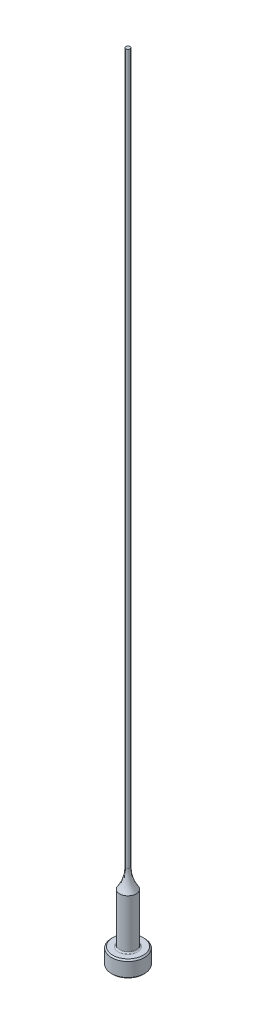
from build123d import *

# Parameters (mm, degrees)
CHAMFER1_SIZE = 0.254
FILLET1_R     = 0.254


with BuildPart() as part:
    # Sketch1 → Revolve1 (revolve)
    with BuildSketch(Plane.XY, mode=Mode.PRIVATE) as revolve1_sk:
        with BuildLine():
            Line((0, 0), (-3.175, 0))
            Line((-3.175, 0), (-3.175, 3.175))
            Line((-3.175, 3.175), (-1.5875, 3.175))
            Line((-1.5875, 3.175), (-1.5875, 12.7))
            ThreePointArc((-1.5875, 12.7), (-0.701386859, 14.457887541), (-0.39624, 16.40268843))
            Line((-0.39624, 16.40268843), (-0.39624, 152.4))
            Line((-0.39624, 152.4), (0, 152.4))
            Line((0, 152.4), (0, 0))
        make_face()
    revolve(revolve1_sk.sketch.rotate(Axis((0, 259.958771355, 0), (0, -1, 0)), 270), axis=Axis((0, 259.958771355, 0), (0, -1, 0)))

    # Chamfer1
    chamfer1_edges = [part.edges().sort_by_distance(p)[0] for p in [
        (0, 0, -3.175),
        (0, 3.175, -3.175),
    ]]
    chamfer(chamfer1_edges, length=CHAMFER1_SIZE)

    # Fillet1
    fillet1_edges = [part.edges().sort_by_distance(p)[0] for p in [
        (0, 3.175, -1.5875),
    ]]
    fillet(fillet1_edges, radius=FILLET1_R)


solid = part.part
